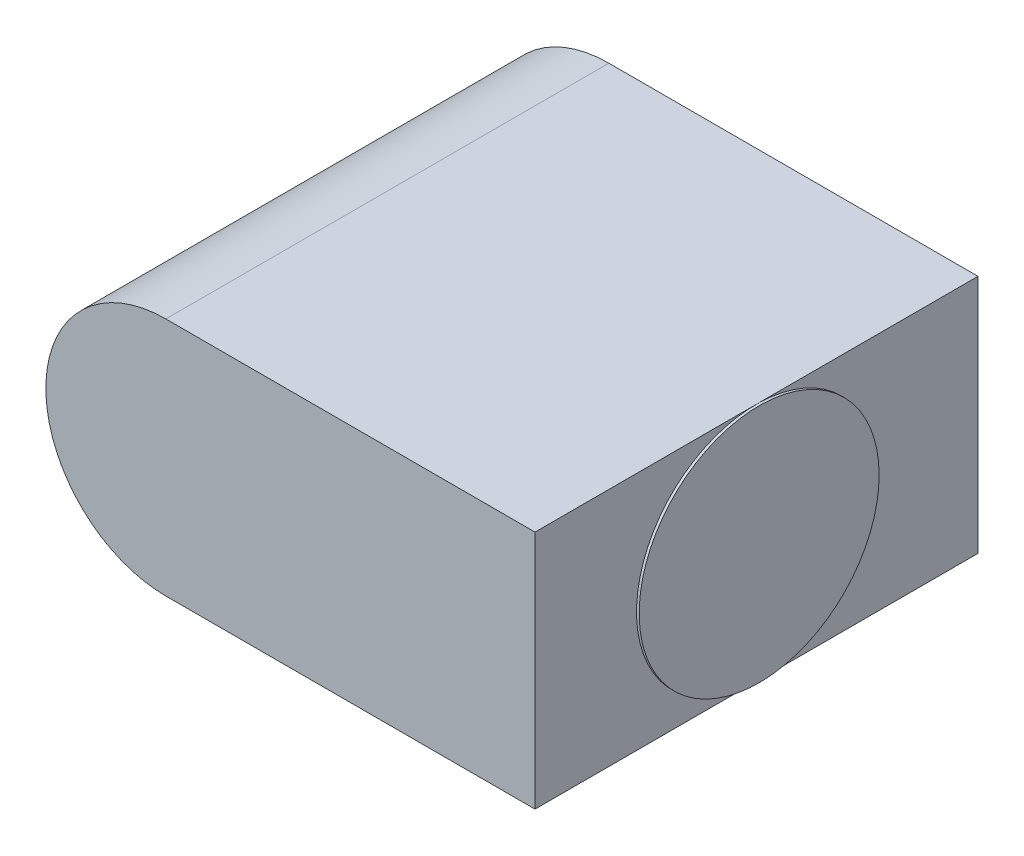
ISO-10303-21;
HEADER;
FILE_DESCRIPTION(('STEP AP214'),'2;1');
FILE_NAME('part.step','',(''),(''),'','','');
FILE_SCHEMA(('AUTOMOTIVE_DESIGN { 1 0 10303 214 1 1 1 1 }'));
ENDSEC;
DATA;
#1=APPLICATION_CONTEXT('core data for automotive mechanical design processes');
#2=APPLICATION_PROTOCOL_DEFINITION('international standard','automotive_design',2000,#1);
#3=PRODUCT_CONTEXT('',#1,'mechanical');
#4=PRODUCT('Part','Part','',(#3));
#5=PRODUCT_RELATED_PRODUCT_CATEGORY('part','',(#4));
#6=PRODUCT_DEFINITION_FORMATION('','',#4);
#7=PRODUCT_DEFINITION_CONTEXT('part definition',#1,'design');
#8=PRODUCT_DEFINITION('design','',#6,#7);
#9=PRODUCT_DEFINITION_SHAPE('','',#8);
#10=(LENGTH_UNIT() NAMED_UNIT(*) SI_UNIT(.MILLI.,.METRE.));
#11=(NAMED_UNIT(*) PLANE_ANGLE_UNIT() SI_UNIT($,.RADIAN.));
#12=(NAMED_UNIT(*) SI_UNIT($,.STERADIAN.) SOLID_ANGLE_UNIT());
#13=UNCERTAINTY_MEASURE_WITH_UNIT(LENGTH_MEASURE(1.E-05),#10,'distance_accuracy_value','');
#14=(GEOMETRIC_REPRESENTATION_CONTEXT(3) GLOBAL_UNCERTAINTY_ASSIGNED_CONTEXT((#13)) GLOBAL_UNIT_ASSIGNED_CONTEXT((#10,
#11,#12)) REPRESENTATION_CONTEXT('',''));
#15=CARTESIAN_POINT('',(0.,0.,0.));
#16=DIRECTION('',(0.,0.,1.));
#17=DIRECTION('',(1.,0.,0.));
#18=AXIS2_PLACEMENT_3D('',#15,#16,#17);
#19=CARTESIAN_POINT('',(70.5,0.,-42.));
#20=DIRECTION('',(-1.,0.,0.));
#21=DIRECTION('',(0.,0.,1.));
#22=AXIS2_PLACEMENT_3D('',#19,#20,#21);
#23=CYLINDRICAL_SURFACE('',#22,22.75);
#24=CARTESIAN_POINT('',(70.5,0.,-42.));
#25=DIRECTION('',(1.,0.,0.));
#26=DIRECTION('',(0.,0.,-1.));
#27=AXIS2_PLACEMENT_3D('',#24,#25,#26);
#28=CIRCLE('',#27,22.75);
#29=CARTESIAN_POINT('',(70.5,0.,-64.75));
#30=VERTEX_POINT('',#29);
#31=EDGE_CURVE('E11',#30,#30,#28,.T.);
#32=ORIENTED_EDGE('',*,*,#31,.F.);
#33=EDGE_LOOP('',(#32));
#34=FACE_BOUND('',#33,.T.);
#35=CARTESIAN_POINT('',(70.,0.,-42.));
#36=DIRECTION('',(1.,0.,0.));
#37=DIRECTION('',(0.,0.,-1.));
#38=AXIS2_PLACEMENT_3D('',#35,#36,#37);
#39=CIRCLE('',#38,22.75);
#40=CARTESIAN_POINT('',(70.,0.,-64.75));
#41=VERTEX_POINT('',#40);
#42=EDGE_CURVE('E49',#41,#41,#39,.T.);
#43=ORIENTED_EDGE('',*,*,#42,.T.);
#44=EDGE_LOOP('',(#43));
#45=FACE_BOUND('',#44,.T.);
#46=ADVANCED_FACE('F46',(#34,#45),#23,.T.);
#47=CARTESIAN_POINT('',(70.5,0.,-42.));
#48=DIRECTION('',(1.,0.,0.));
#49=DIRECTION('',(0.,0.,-1.));
#50=AXIS2_PLACEMENT_3D('',#47,#48,#49);
#51=PLANE('',#50);
#52=ORIENTED_EDGE('',*,*,#31,.T.);
#53=EDGE_LOOP('',(#52));
#54=FACE_BOUND('',#53,.T.);
#55=ADVANCED_FACE('F61',(#54),#51,.T.);
#56=CARTESIAN_POINT('',(70.,0.,-42.));
#57=DIRECTION('',(1.,0.,0.));
#58=DIRECTION('',(0.,0.,-1.));
#59=AXIS2_PLACEMENT_3D('',#56,#57,#58);
#60=PLANE('',#59);
#61=ORIENTED_EDGE('',*,*,#42,.F.);
#62=EDGE_LOOP('',(#61));
#63=FACE_BOUND('',#62,.T.);
#64=ADVANCED_FACE('F59',(#63),#60,.F.);
#65=CLOSED_SHELL('',(#46,#55,#64));
#66=MANIFOLD_SOLID_BREP('B2',#65);
#67=CARTESIAN_POINT('',(0.,0.,-84.));
#68=DIRECTION('',(0.,0.,1.));
#69=DIRECTION('',(1.,0.,0.));
#70=AXIS2_PLACEMENT_3D('',#67,#68,#69);
#71=CYLINDRICAL_SURFACE('',#70,22.75);
#72=CARTESIAN_POINT('',(0.,0.,0.));
#73=DIRECTION('',(0.,0.,1.));
#74=DIRECTION('',(1.,0.,0.));
#75=AXIS2_PLACEMENT_3D('',#72,#73,#74);
#76=CIRCLE('',#75,22.75);
#77=CARTESIAN_POINT('',(0.,22.75,0.));
#78=VERTEX_POINT('',#77);
#79=CARTESIAN_POINT('',(0.,-22.75,0.));
#80=VERTEX_POINT('',#79);
#81=EDGE_CURVE('E150',#78,#80,#76,.T.);
#82=ORIENTED_EDGE('',*,*,#81,.F.);
#83=DIRECTION('',(0.,0.,1.));
#84=VECTOR('',#83,1.);
#85=CARTESIAN_POINT('',(0.,22.75,-84.));
#86=LINE('',#85,#84);
#87=CARTESIAN_POINT('',(0.,22.75,-84.));
#88=VERTEX_POINT('',#87);
#89=EDGE_CURVE('E44',#88,#78,#86,.T.);
#90=ORIENTED_EDGE('',*,*,#89,.F.);
#91=CARTESIAN_POINT('',(0.,0.,-84.));
#92=DIRECTION('',(0.,0.,1.));
#93=DIRECTION('',(1.,0.,0.));
#94=AXIS2_PLACEMENT_3D('',#91,#92,#93);
#95=CIRCLE('',#94,22.75);
#96=CARTESIAN_POINT('',(0.,-22.75,-84.));
#97=VERTEX_POINT('',#96);
#98=EDGE_CURVE('E144',#88,#97,#95,.T.);
#99=ORIENTED_EDGE('',*,*,#98,.T.);
#100=DIRECTION('',(0.,0.,1.));
#101=VECTOR('',#100,1.);
#102=CARTESIAN_POINT('',(0.,-22.75,-84.));
#103=LINE('',#102,#101);
#104=EDGE_CURVE('E89',#97,#80,#103,.T.);
#105=ORIENTED_EDGE('',*,*,#104,.T.);
#106=EDGE_LOOP('',(#82,#90,#99,#105));
#107=FACE_BOUND('',#106,.T.);
#108=ADVANCED_FACE('F86',(#107),#71,.T.);
#109=CARTESIAN_POINT('',(0.,22.75,-84.));
#110=DIRECTION('',(0.,1.,0.));
#111=DIRECTION('',(0.,0.,1.));
#112=AXIS2_PLACEMENT_3D('',#109,#110,#111);
#113=PLANE('',#112);
#114=DIRECTION('',(-1.,0.,0.));
#115=VECTOR('',#114,1.);
#116=CARTESIAN_POINT('',(0.,22.75,0.));
#117=LINE('',#116,#115);
#118=CARTESIAN_POINT('',(70.,22.75,0.));
#119=VERTEX_POINT('',#118);
#120=EDGE_CURVE('E146',#119,#78,#117,.T.);
#121=ORIENTED_EDGE('',*,*,#120,.F.);
#122=DIRECTION('',(0.,0.,1.));
#123=VECTOR('',#122,1.);
#124=CARTESIAN_POINT('',(70.,22.75,-84.));
#125=LINE('',#124,#123);
#126=CARTESIAN_POINT('',(70.,22.75,-84.));
#127=VERTEX_POINT('',#126);
#128=EDGE_CURVE('E95',#127,#119,#125,.T.);
#129=ORIENTED_EDGE('',*,*,#128,.F.);
#130=DIRECTION('',(-1.,0.,0.));
#131=VECTOR('',#130,1.);
#132=CARTESIAN_POINT('',(0.,22.75,-84.));
#133=LINE('',#132,#131);
#134=EDGE_CURVE('E141',#127,#88,#133,.T.);
#135=ORIENTED_EDGE('',*,*,#134,.T.);
#136=ORIENTED_EDGE('',*,*,#89,.T.);
#137=EDGE_LOOP('',(#121,#129,#135,#136));
#138=FACE_BOUND('',#137,.T.);
#139=ADVANCED_FACE('F160',(#138),#113,.T.);
#140=CARTESIAN_POINT('',(70.,22.75,-84.));
#141=DIRECTION('',(1.,0.,0.));
#142=DIRECTION('',(0.,0.,-1.));
#143=AXIS2_PLACEMENT_3D('',#140,#141,#142);
#144=PLANE('',#143);
#145=DIRECTION('',(0.,1.,0.));
#146=VECTOR('',#145,1.);
#147=CARTESIAN_POINT('',(70.,22.75,0.));
#148=LINE('',#147,#146);
#149=CARTESIAN_POINT('',(70.,-22.75,0.));
#150=VERTEX_POINT('',#149);
#151=EDGE_CURVE('E136',#150,#119,#148,.T.);
#152=ORIENTED_EDGE('',*,*,#151,.F.);
#153=DIRECTION('',(0.,0.,1.));
#154=VECTOR('',#153,1.);
#155=CARTESIAN_POINT('',(70.,-22.75,-84.));
#156=LINE('',#155,#154);
#157=CARTESIAN_POINT('',(70.,-22.75,-84.));
#158=VERTEX_POINT('',#157);
#159=EDGE_CURVE('E131',#158,#150,#156,.T.);
#160=ORIENTED_EDGE('',*,*,#159,.F.);
#161=DIRECTION('',(0.,1.,0.));
#162=VECTOR('',#161,1.);
#163=CARTESIAN_POINT('',(70.,22.75,-84.));
#164=LINE('',#163,#162);
#165=EDGE_CURVE('E134',#158,#127,#164,.T.);
#166=ORIENTED_EDGE('',*,*,#165,.T.);
#167=ORIENTED_EDGE('',*,*,#128,.T.);
#168=EDGE_LOOP('',(#152,#160,#166,#167));
#169=FACE_BOUND('',#168,.T.);
#170=ADVANCED_FACE('F133',(#169),#144,.T.);
#171=CARTESIAN_POINT('',(0.,-22.75,-84.));
#172=DIRECTION('',(0.,-1.,0.));
#173=DIRECTION('',(0.,0.,-1.));
#174=AXIS2_PLACEMENT_3D('',#171,#172,#173);
#175=PLANE('',#174);
#176=DIRECTION('',(1.,0.,0.));
#177=VECTOR('',#176,1.);
#178=CARTESIAN_POINT('',(0.,-22.75,0.));
#179=LINE('',#178,#177);
#180=EDGE_CURVE('E153',#80,#150,#179,.T.);
#181=ORIENTED_EDGE('',*,*,#180,.F.);
#182=ORIENTED_EDGE('',*,*,#104,.F.);
#183=DIRECTION('',(1.,0.,0.));
#184=VECTOR('',#183,1.);
#185=CARTESIAN_POINT('',(0.,-22.75,-84.));
#186=LINE('',#185,#184);
#187=EDGE_CURVE('E140',#97,#158,#186,.T.);
#188=ORIENTED_EDGE('',*,*,#187,.T.);
#189=ORIENTED_EDGE('',*,*,#159,.T.);
#190=EDGE_LOOP('',(#181,#182,#188,#189));
#191=FACE_BOUND('',#190,.T.);
#192=ADVANCED_FACE('F143',(#191),#175,.T.);
#193=CARTESIAN_POINT('',(0.,0.,-84.));
#194=DIRECTION('',(0.,0.,1.));
#195=DIRECTION('',(1.,0.,0.));
#196=AXIS2_PLACEMENT_3D('',#193,#194,#195);
#197=PLANE('',#196);
#198=ORIENTED_EDGE('',*,*,#98,.F.);
#199=ORIENTED_EDGE('',*,*,#134,.F.);
#200=ORIENTED_EDGE('',*,*,#165,.F.);
#201=ORIENTED_EDGE('',*,*,#187,.F.);
#202=EDGE_LOOP('',(#198,#199,#200,#201));
#203=FACE_BOUND('',#202,.T.);
#204=ADVANCED_FACE('F139',(#203),#197,.F.);
#205=CARTESIAN_POINT('',(0.,0.,0.));
#206=DIRECTION('',(0.,0.,1.));
#207=DIRECTION('',(1.,0.,0.));
#208=AXIS2_PLACEMENT_3D('',#205,#206,#207);
#209=PLANE('',#208);
#210=ORIENTED_EDGE('',*,*,#81,.T.);
#211=ORIENTED_EDGE('',*,*,#180,.T.);
#212=ORIENTED_EDGE('',*,*,#151,.T.);
#213=ORIENTED_EDGE('',*,*,#120,.T.);
#214=EDGE_LOOP('',(#210,#211,#212,#213));
#215=FACE_BOUND('',#214,.T.);
#216=ADVANCED_FACE('F159',(#215),#209,.T.);
#217=CLOSED_SHELL('',(#108,#139,#170,#192,#204,#216));
#218=MANIFOLD_SOLID_BREP('B6',#217);
#219=ADVANCED_BREP_SHAPE_REPRESENTATION('',(#18,#66,#218),#14);
#220=SHAPE_DEFINITION_REPRESENTATION(#9,#219);
ENDSEC;
END-ISO-10303-21;
